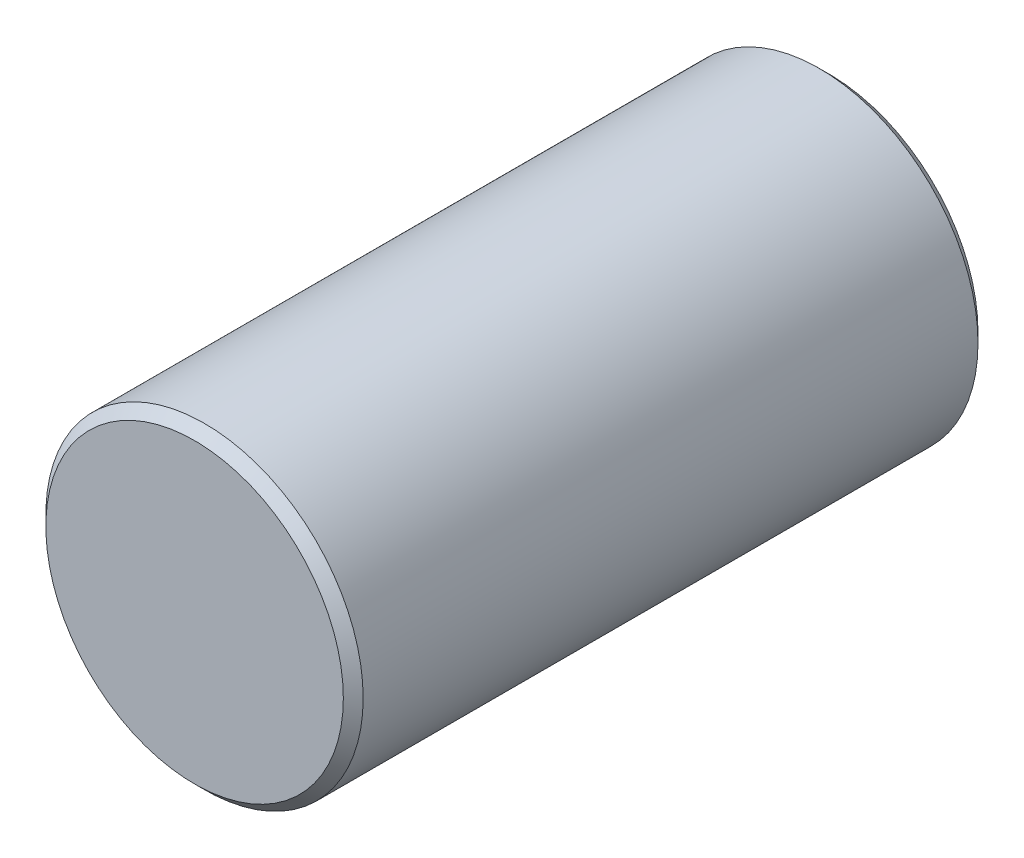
from build123d import *


with BuildPart() as part:
    # Sketch1 → Revolve1 (revolve)
    with BuildSketch(Plane(origin=(0, 0, 0), x_dir=(0, 0, -1), z_dir=(1, 0, 0)), mode=Mode.PRIVATE) as revolve1_sk:
        Polygon((0, 0), (16, 0), (16, 3.749986), (15.749986, 4), (0.250014, 4), (0, 3.749986), align=None)
    revolve(revolve1_sk.sketch.rotate(Axis((0, 0, -10.674691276), (0, 0, -1)), 90), axis=Axis((0, 0, -10.674691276), (0, 0, -1)))


solid = part.part
